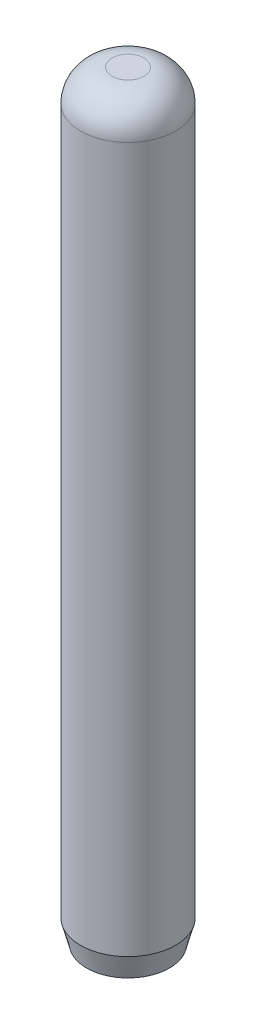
from build123d import *


with BuildPart() as part:
    # Sketch1 → Base-Revolve (revolve)
    with BuildSketch(Plane.XY):
        with BuildLine():
            Line((1.191893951, 0), (1.191893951, 19.05))
            Line((1.191893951, 19.05), (1.590037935, 19.05))
            ThreePointArc((1.590037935, 19.05), (2.151303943, 18.817516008), (2.383787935, 18.25625))
            Line((2.383787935, 18.25625), (2.383787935, 0.572109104))
            Line((2.383787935, 0.572109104), (2.230491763, 0))
            Line((2.230491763, 0), (1.191893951, 0))
        make_face()
    revolve(axis=Axis((1.191893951, 0, 0), (0, 1, 0)))


solid = part.part
